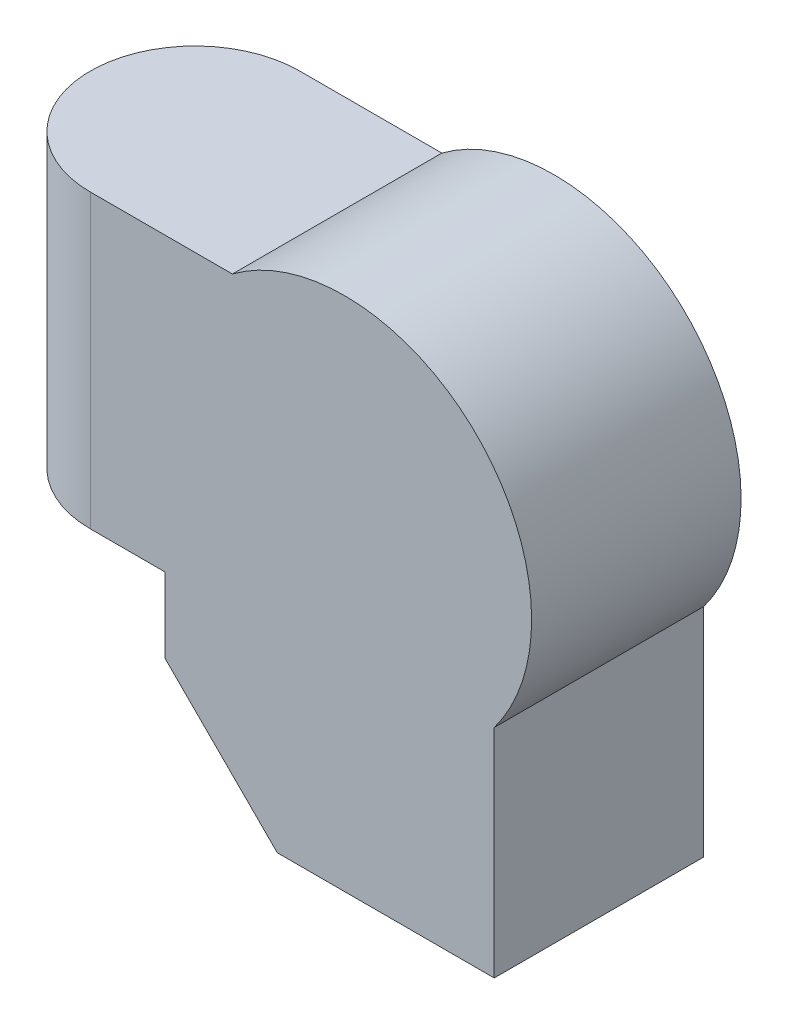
ISO-10303-21;
HEADER;
FILE_DESCRIPTION(('STEP AP214'),'2;1');
FILE_NAME('part.step','',(''),(''),'','','');
FILE_SCHEMA(('AUTOMOTIVE_DESIGN { 1 0 10303 214 1 1 1 1 }'));
ENDSEC;
DATA;
#1=APPLICATION_CONTEXT('core data for automotive mechanical design processes');
#2=APPLICATION_PROTOCOL_DEFINITION('international standard','automotive_design',2000,#1);
#3=PRODUCT_CONTEXT('',#1,'mechanical');
#4=PRODUCT('Part','Part','',(#3));
#5=PRODUCT_RELATED_PRODUCT_CATEGORY('part','',(#4));
#6=PRODUCT_DEFINITION_FORMATION('','',#4);
#7=PRODUCT_DEFINITION_CONTEXT('part definition',#1,'design');
#8=PRODUCT_DEFINITION('design','',#6,#7);
#9=PRODUCT_DEFINITION_SHAPE('','',#8);
#10=(LENGTH_UNIT() NAMED_UNIT(*) SI_UNIT(.MILLI.,.METRE.));
#11=(NAMED_UNIT(*) PLANE_ANGLE_UNIT() SI_UNIT($,.RADIAN.));
#12=(NAMED_UNIT(*) SI_UNIT($,.STERADIAN.) SOLID_ANGLE_UNIT());
#13=UNCERTAINTY_MEASURE_WITH_UNIT(LENGTH_MEASURE(1.E-05),#10,'distance_accuracy_value','');
#14=(GEOMETRIC_REPRESENTATION_CONTEXT(3) GLOBAL_UNCERTAINTY_ASSIGNED_CONTEXT((#13)) GLOBAL_UNIT_ASSIGNED_CONTEXT((#10,
#11,#12)) REPRESENTATION_CONTEXT('',''));
#15=CARTESIAN_POINT('',(0.,0.,0.));
#16=DIRECTION('',(0.,0.,1.));
#17=DIRECTION('',(1.,0.,0.));
#18=AXIS2_PLACEMENT_3D('',#15,#16,#17);
#19=CARTESIAN_POINT('',(-24.,-29.,28.));
#20=DIRECTION('',(0.707106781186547,0.707106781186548,0.));
#21=DIRECTION('',(-0.707106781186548,0.707106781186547,0.));
#22=AXIS2_PLACEMENT_3D('',#19,#20,#21);
#23=PLANE('',#22);
#24=DIRECTION('',(0.707106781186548,-0.707106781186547,0.));
#25=VECTOR('',#24,1.);
#26=CARTESIAN_POINT('',(-24.,-29.,0.));
#27=LINE('',#26,#25);
#28=CARTESIAN_POINT('',(-24.,-29.,0.));
#29=VERTEX_POINT('',#28);
#30=CARTESIAN_POINT('',(-8.99999999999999,-44.,0.));
#31=VERTEX_POINT('',#30);
#32=EDGE_CURVE('E140',#29,#31,#27,.T.);
#33=ORIENTED_EDGE('',*,*,#32,.T.);
#34=DIRECTION('',(0.,0.,-1.));
#35=VECTOR('',#34,1.);
#36=CARTESIAN_POINT('',(-8.99999999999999,-44.,28.));
#37=LINE('',#36,#35);
#38=CARTESIAN_POINT('',(-8.99999999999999,-44.,28.));
#39=VERTEX_POINT('',#38);
#40=EDGE_CURVE('E33',#39,#31,#37,.T.);
#41=ORIENTED_EDGE('',*,*,#40,.F.);
#42=DIRECTION('',(0.707106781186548,-0.707106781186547,0.));
#43=VECTOR('',#42,1.);
#44=CARTESIAN_POINT('',(-24.,-29.,28.));
#45=LINE('',#44,#43);
#46=CARTESIAN_POINT('',(-24.,-29.,28.));
#47=VERTEX_POINT('',#46);
#48=EDGE_CURVE('E156',#47,#39,#45,.T.);
#49=ORIENTED_EDGE('',*,*,#48,.F.);
#50=DIRECTION('',(0.,0.,-1.));
#51=VECTOR('',#50,1.);
#52=CARTESIAN_POINT('',(-24.,-29.,28.));
#53=LINE('',#52,#51);
#54=EDGE_CURVE('E116',#47,#29,#53,.T.);
#55=ORIENTED_EDGE('',*,*,#54,.T.);
#56=EDGE_LOOP('',(#33,#41,#49,#55));
#57=FACE_BOUND('',#56,.T.);
#58=ADVANCED_FACE('F26',(#57),#23,.F.);
#59=CARTESIAN_POINT('',(20.,-44.,28.));
#60=DIRECTION('',(0.,1.,0.));
#61=DIRECTION('',(-1.,0.,0.));
#62=AXIS2_PLACEMENT_3D('',#59,#60,#61);
#63=PLANE('',#62);
#64=DIRECTION('',(1.,0.,0.));
#65=VECTOR('',#64,1.);
#66=CARTESIAN_POINT('',(20.,-44.,0.));
#67=LINE('',#66,#65);
#68=CARTESIAN_POINT('',(20.,-44.,0.));
#69=VERTEX_POINT('',#68);
#70=EDGE_CURVE('E135',#31,#69,#67,.T.);
#71=ORIENTED_EDGE('',*,*,#70,.T.);
#72=DIRECTION('',(0.,0.,-1.));
#73=VECTOR('',#72,1.);
#74=CARTESIAN_POINT('',(20.,-44.,28.));
#75=LINE('',#74,#73);
#76=CARTESIAN_POINT('',(20.,-44.,28.));
#77=VERTEX_POINT('',#76);
#78=EDGE_CURVE('E127',#77,#69,#75,.T.);
#79=ORIENTED_EDGE('',*,*,#78,.F.);
#80=DIRECTION('',(1.,0.,0.));
#81=VECTOR('',#80,1.);
#82=CARTESIAN_POINT('',(20.,-44.,28.));
#83=LINE('',#82,#81);
#84=EDGE_CURVE('E136',#39,#77,#83,.T.);
#85=ORIENTED_EDGE('',*,*,#84,.F.);
#86=ORIENTED_EDGE('',*,*,#40,.T.);
#87=EDGE_LOOP('',(#71,#79,#85,#86));
#88=FACE_BOUND('',#87,.T.);
#89=ADVANCED_FACE('F133',(#88),#63,.F.);
#90=CARTESIAN_POINT('',(20.,-44.,28.));
#91=DIRECTION('',(-1.,0.,0.));
#92=DIRECTION('',(0.,-1.,0.));
#93=AXIS2_PLACEMENT_3D('',#90,#91,#92);
#94=PLANE('',#93);
#95=DIRECTION('',(0.,1.,0.));
#96=VECTOR('',#95,1.);
#97=CARTESIAN_POINT('',(20.,-44.,0.));
#98=LINE('',#97,#96);
#99=CARTESIAN_POINT('',(20.,-15.,0.));
#100=VERTEX_POINT('',#99);
#101=EDGE_CURVE('E144',#69,#100,#98,.T.);
#102=ORIENTED_EDGE('',*,*,#101,.T.);
#103=DIRECTION('',(0.,0.,-1.));
#104=VECTOR('',#103,1.);
#105=CARTESIAN_POINT('',(20.,-15.,28.));
#106=LINE('',#105,#104);
#107=CARTESIAN_POINT('',(20.,-15.,28.));
#108=VERTEX_POINT('',#107);
#109=EDGE_CURVE('E124',#108,#100,#106,.T.);
#110=ORIENTED_EDGE('',*,*,#109,.F.);
#111=DIRECTION('',(0.,1.,0.));
#112=VECTOR('',#111,1.);
#113=CARTESIAN_POINT('',(20.,-44.,28.));
#114=LINE('',#113,#112);
#115=EDGE_CURVE('E111',#77,#108,#114,.T.);
#116=ORIENTED_EDGE('',*,*,#115,.F.);
#117=ORIENTED_EDGE('',*,*,#78,.T.);
#118=EDGE_LOOP('',(#102,#110,#116,#117));
#119=FACE_BOUND('',#118,.T.);
#120=ADVANCED_FACE('F161',(#119),#94,.F.);
#121=CARTESIAN_POINT('',(0.,0.,28.));
#122=DIRECTION('',(0.,0.,-1.));
#123=DIRECTION('',(-1.,0.,0.));
#124=AXIS2_PLACEMENT_3D('',#121,#122,#123);
#125=CYLINDRICAL_SURFACE('',#124,25.);
#126=CARTESIAN_POINT('',(0.,0.,0.));
#127=DIRECTION('',(0.,0.,1.));
#128=DIRECTION('',(1.,0.,0.));
#129=AXIS2_PLACEMENT_3D('',#126,#127,#128);
#130=CIRCLE('',#129,25.);
#131=CARTESIAN_POINT('',(-15.,20.,0.));
#132=VERTEX_POINT('',#131);
#133=EDGE_CURVE('E149',#100,#132,#130,.T.);
#134=ORIENTED_EDGE('',*,*,#133,.T.);
#135=DIRECTION('',(0.,0.,-1.));
#136=VECTOR('',#135,1.);
#137=CARTESIAN_POINT('',(-15.,20.,28.));
#138=LINE('',#137,#136);
#139=CARTESIAN_POINT('',(-15.,20.,28.));
#140=VERTEX_POINT('',#139);
#141=EDGE_CURVE('E122',#140,#132,#138,.T.);
#142=ORIENTED_EDGE('',*,*,#141,.F.);
#143=CARTESIAN_POINT('',(0.,0.,28.));
#144=DIRECTION('',(0.,0.,1.));
#145=DIRECTION('',(1.,0.,0.));
#146=AXIS2_PLACEMENT_3D('',#143,#144,#145);
#147=CIRCLE('',#146,25.);
#148=EDGE_CURVE('E106',#108,#140,#147,.T.);
#149=ORIENTED_EDGE('',*,*,#148,.F.);
#150=ORIENTED_EDGE('',*,*,#109,.T.);
#151=EDGE_LOOP('',(#134,#142,#149,#150));
#152=FACE_BOUND('',#151,.T.);
#153=ADVANCED_FACE('F165',(#152),#125,.T.);
#154=CARTESIAN_POINT('',(-48.,20.,28.));
#155=DIRECTION('',(0.,-1.,0.));
#156=DIRECTION('',(1.,0.,0.));
#157=AXIS2_PLACEMENT_3D('',#154,#155,#156);
#158=PLANE('',#157);
#159=DIRECTION('',(-1.,0.,0.));
#160=VECTOR('',#159,1.);
#161=CARTESIAN_POINT('',(-48.,20.,0.));
#162=LINE('',#161,#160);
#163=CARTESIAN_POINT('',(-34.,20.,0.));
#164=VERTEX_POINT('',#163);
#165=EDGE_CURVE('E95',#132,#164,#162,.T.);
#166=ORIENTED_EDGE('',*,*,#165,.T.);
#167=CARTESIAN_POINT('',(-34.,20.,14.));
#168=DIRECTION('',(0.,-1.,0.));
#169=DIRECTION('',(0.,0.,1.));
#170=AXIS2_PLACEMENT_3D('',#167,#168,#169);
#171=CIRCLE('',#170,14.);
#172=CARTESIAN_POINT('',(-34.,20.,28.));
#173=VERTEX_POINT('',#172);
#174=EDGE_CURVE('E40',#173,#164,#171,.T.);
#175=ORIENTED_EDGE('',*,*,#174,.F.);
#176=DIRECTION('',(-1.,0.,0.));
#177=VECTOR('',#176,1.);
#178=CARTESIAN_POINT('',(-48.,20.,28.));
#179=LINE('',#178,#177);
#180=EDGE_CURVE('E93',#140,#173,#179,.T.);
#181=ORIENTED_EDGE('',*,*,#180,.F.);
#182=ORIENTED_EDGE('',*,*,#141,.T.);
#183=EDGE_LOOP('',(#166,#175,#181,#182));
#184=FACE_BOUND('',#183,.T.);
#185=ADVANCED_FACE('F90',(#184),#158,.F.);
#186=CARTESIAN_POINT('',(-48.,-19.,28.));
#187=DIRECTION('',(0.,1.,0.));
#188=DIRECTION('',(0.,0.,1.));
#189=AXIS2_PLACEMENT_3D('',#186,#187,#188);
#190=PLANE('',#189);
#191=DIRECTION('',(1.,0.,0.));
#192=VECTOR('',#191,1.);
#193=CARTESIAN_POINT('',(-48.,-19.,28.));
#194=LINE('',#193,#192);
#195=CARTESIAN_POINT('',(-34.,-19.,28.));
#196=VERTEX_POINT('',#195);
#197=CARTESIAN_POINT('',(-24.,-19.,28.));
#198=VERTEX_POINT('',#197);
#199=EDGE_CURVE('E108',#196,#198,#194,.T.);
#200=ORIENTED_EDGE('',*,*,#199,.F.);
#201=CARTESIAN_POINT('',(-34.,-19.,14.));
#202=DIRECTION('',(0.,1.,0.));
#203=DIRECTION('',(0.,0.,1.));
#204=AXIS2_PLACEMENT_3D('',#201,#202,#203);
#205=CIRCLE('',#204,14.);
#206=CARTESIAN_POINT('',(-34.,-19.,0.));
#207=VERTEX_POINT('',#206);
#208=EDGE_CURVE('E101',#196,#207,#205,.F.);
#209=ORIENTED_EDGE('',*,*,#208,.T.);
#210=DIRECTION('',(1.,0.,0.));
#211=VECTOR('',#210,1.);
#212=CARTESIAN_POINT('',(-48.,-19.,0.));
#213=LINE('',#212,#211);
#214=CARTESIAN_POINT('',(-24.,-19.,0.));
#215=VERTEX_POINT('',#214);
#216=EDGE_CURVE('E152',#207,#215,#213,.T.);
#217=ORIENTED_EDGE('',*,*,#216,.T.);
#218=DIRECTION('',(0.,0.,-1.));
#219=VECTOR('',#218,1.);
#220=CARTESIAN_POINT('',(-24.,-19.,28.));
#221=LINE('',#220,#219);
#222=EDGE_CURVE('E119',#198,#215,#221,.T.);
#223=ORIENTED_EDGE('',*,*,#222,.F.);
#224=EDGE_LOOP('',(#200,#209,#217,#223));
#225=FACE_BOUND('',#224,.T.);
#226=ADVANCED_FACE('F169',(#225),#190,.F.);
#227=CARTESIAN_POINT('',(-24.,-19.,28.));
#228=DIRECTION('',(1.,0.,0.));
#229=DIRECTION('',(0.,1.,0.));
#230=AXIS2_PLACEMENT_3D('',#227,#228,#229);
#231=PLANE('',#230);
#232=DIRECTION('',(0.,-1.,0.));
#233=VECTOR('',#232,1.);
#234=CARTESIAN_POINT('',(-24.,-19.,0.));
#235=LINE('',#234,#233);
#236=EDGE_CURVE('E154',#215,#29,#235,.T.);
#237=ORIENTED_EDGE('',*,*,#236,.T.);
#238=ORIENTED_EDGE('',*,*,#54,.F.);
#239=DIRECTION('',(0.,-1.,0.));
#240=VECTOR('',#239,1.);
#241=CARTESIAN_POINT('',(-24.,-19.,28.));
#242=LINE('',#241,#240);
#243=EDGE_CURVE('E47',#198,#47,#242,.T.);
#244=ORIENTED_EDGE('',*,*,#243,.F.);
#245=ORIENTED_EDGE('',*,*,#222,.T.);
#246=EDGE_LOOP('',(#237,#238,#244,#245));
#247=FACE_BOUND('',#246,.T.);
#248=ADVANCED_FACE('F172',(#247),#231,.F.);
#249=CARTESIAN_POINT('',(0.,0.,28.));
#250=DIRECTION('',(0.,0.,1.));
#251=DIRECTION('',(1.,0.,0.));
#252=AXIS2_PLACEMENT_3D('',#249,#250,#251);
#253=PLANE('',#252);
#254=DIRECTION('',(0.,1.,0.));
#255=VECTOR('',#254,1.);
#256=CARTESIAN_POINT('',(-34.,-44.,28.));
#257=LINE('',#256,#255);
#258=EDGE_CURVE('E96',#196,#173,#257,.T.);
#259=ORIENTED_EDGE('',*,*,#258,.F.);
#260=ORIENTED_EDGE('',*,*,#199,.T.);
#261=ORIENTED_EDGE('',*,*,#243,.T.);
#262=ORIENTED_EDGE('',*,*,#48,.T.);
#263=ORIENTED_EDGE('',*,*,#84,.T.);
#264=ORIENTED_EDGE('',*,*,#115,.T.);
#265=ORIENTED_EDGE('',*,*,#148,.T.);
#266=ORIENTED_EDGE('',*,*,#180,.T.);
#267=EDGE_LOOP('',(#259,#260,#261,#262,#263,#264,#265,#266));
#268=FACE_BOUND('',#267,.T.);
#269=ADVANCED_FACE('F104',(#268),#253,.T.);
#270=CARTESIAN_POINT('',(0.,0.,0.));
#271=DIRECTION('',(0.,0.,1.));
#272=DIRECTION('',(1.,0.,0.));
#273=AXIS2_PLACEMENT_3D('',#270,#271,#272);
#274=PLANE('',#273);
#275=ORIENTED_EDGE('',*,*,#216,.F.);
#276=DIRECTION('',(0.,1.,0.));
#277=VECTOR('',#276,1.);
#278=CARTESIAN_POINT('',(-34.,0.,0.));
#279=LINE('',#278,#277);
#280=EDGE_CURVE('E11',#207,#164,#279,.T.);
#281=ORIENTED_EDGE('',*,*,#280,.T.);
#282=ORIENTED_EDGE('',*,*,#165,.F.);
#283=ORIENTED_EDGE('',*,*,#133,.F.);
#284=ORIENTED_EDGE('',*,*,#101,.F.);
#285=ORIENTED_EDGE('',*,*,#70,.F.);
#286=ORIENTED_EDGE('',*,*,#32,.F.);
#287=ORIENTED_EDGE('',*,*,#236,.F.);
#288=EDGE_LOOP('',(#275,#281,#282,#283,#284,#285,#286,#287));
#289=FACE_BOUND('',#288,.T.);
#290=ADVANCED_FACE('F167',(#289),#274,.F.);
#291=CARTESIAN_POINT('',(-34.,-44.,14.));
#292=DIRECTION('',(0.,1.,0.));
#293=DIRECTION('',(0.,0.,1.));
#294=AXIS2_PLACEMENT_3D('',#291,#292,#293);
#295=CYLINDRICAL_SURFACE('',#294,14.);
#296=ORIENTED_EDGE('',*,*,#174,.T.);
#297=ORIENTED_EDGE('',*,*,#280,.F.);
#298=ORIENTED_EDGE('',*,*,#208,.F.);
#299=ORIENTED_EDGE('',*,*,#258,.T.);
#300=EDGE_LOOP('',(#296,#297,#298,#299));
#301=FACE_BOUND('',#300,.T.);
#302=ADVANCED_FACE('F99',(#301),#295,.T.);
#303=CLOSED_SHELL('',(#58,#89,#120,#153,#185,#226,#248,#269,#290,#302));
#304=MANIFOLD_SOLID_BREP('B2',#303);
#305=ADVANCED_BREP_SHAPE_REPRESENTATION('',(#18,#304),#14);
#306=SHAPE_DEFINITION_REPRESENTATION(#9,#305);
ENDSEC;
END-ISO-10303-21;
